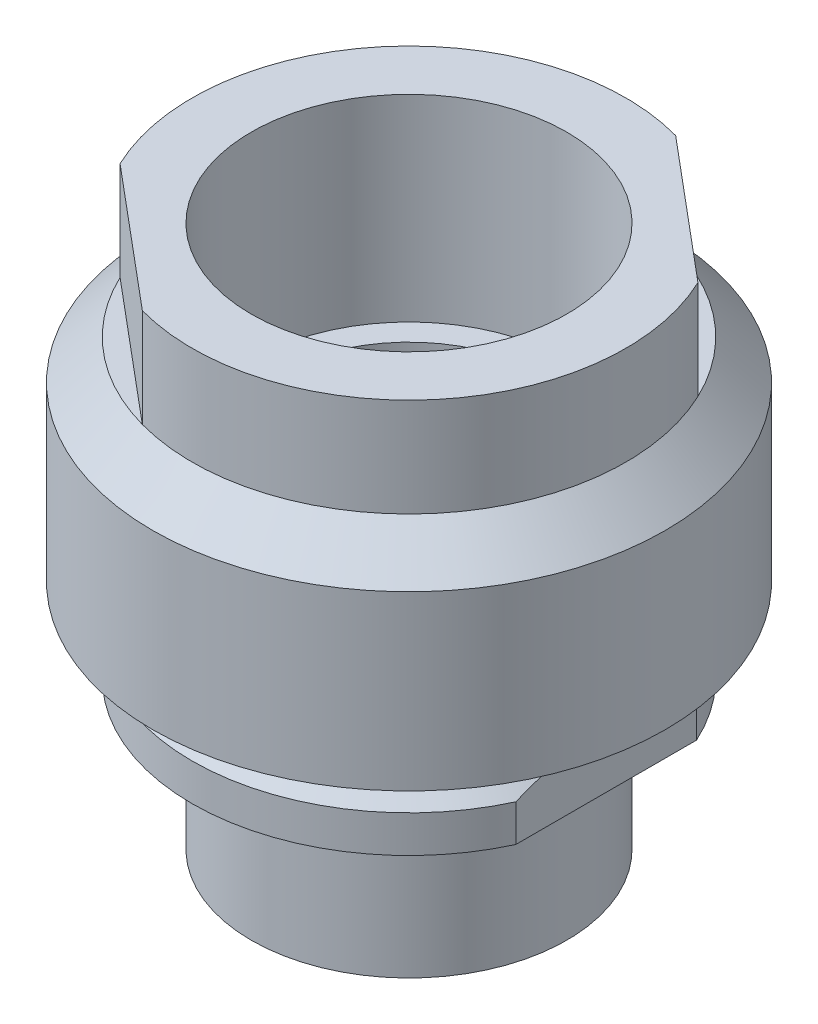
ISO-10303-21;
HEADER;
FILE_DESCRIPTION(('STEP AP214'),'2;1');
FILE_NAME('part.step','',(''),(''),'','','');
FILE_SCHEMA(('AUTOMOTIVE_DESIGN { 1 0 10303 214 1 1 1 1 }'));
ENDSEC;
DATA;
#1=APPLICATION_CONTEXT('core data for automotive mechanical design processes');
#2=APPLICATION_PROTOCOL_DEFINITION('international standard','automotive_design',2000,#1);
#3=PRODUCT_CONTEXT('',#1,'mechanical');
#4=PRODUCT('Part','Part','',(#3));
#5=PRODUCT_RELATED_PRODUCT_CATEGORY('part','',(#4));
#6=PRODUCT_DEFINITION_FORMATION('','',#4);
#7=PRODUCT_DEFINITION_CONTEXT('part definition',#1,'design');
#8=PRODUCT_DEFINITION('design','',#6,#7);
#9=PRODUCT_DEFINITION_SHAPE('','',#8);
#10=(LENGTH_UNIT() NAMED_UNIT(*) SI_UNIT(.MILLI.,.METRE.));
#11=(NAMED_UNIT(*) PLANE_ANGLE_UNIT() SI_UNIT($,.RADIAN.));
#12=(NAMED_UNIT(*) SI_UNIT($,.STERADIAN.) SOLID_ANGLE_UNIT());
#13=UNCERTAINTY_MEASURE_WITH_UNIT(LENGTH_MEASURE(1.E-05),#10,'distance_accuracy_value','');
#14=(GEOMETRIC_REPRESENTATION_CONTEXT(3) GLOBAL_UNCERTAINTY_ASSIGNED_CONTEXT((#13)) GLOBAL_UNIT_ASSIGNED_CONTEXT((#10,
#11,#12)) REPRESENTATION_CONTEXT('',''));
#15=CARTESIAN_POINT('',(0.,0.,0.));
#16=DIRECTION('',(0.,0.,1.));
#17=DIRECTION('',(1.,0.,0.));
#18=AXIS2_PLACEMENT_3D('',#15,#16,#17);
#19=CARTESIAN_POINT('',(0.,0.,0.));
#20=DIRECTION('',(0.,-1.,0.));
#21=DIRECTION('',(0.,0.,-1.));
#22=AXIS2_PLACEMENT_3D('',#19,#20,#21);
#23=CYLINDRICAL_SURFACE('',#22,22.);
#24=DIRECTION('',(0.,1.,0.));
#25=VECTOR('',#24,1.);
#26=CARTESIAN_POINT('',(-5.83483890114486,30.,21.2121346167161));
#27=LINE('',#26,#25);
#28=CARTESIAN_POINT('',(-5.83483890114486,30.,21.2121346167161));
#29=VERTEX_POINT('',#28);
#30=CARTESIAN_POINT('',(-5.83483890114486,40.,21.2121346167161));
#31=VERTEX_POINT('',#30);
#32=EDGE_CURVE('E167',#29,#31,#27,.T.);
#33=ORIENTED_EDGE('',*,*,#32,.F.);
#34=CARTESIAN_POINT('',(0.,30.,0.));
#35=DIRECTION('',(0.,-1.,0.));
#36=DIRECTION('',(0.,0.,-1.));
#37=AXIS2_PLACEMENT_3D('',#34,#35,#36);
#38=CIRCLE('',#37,22.);
#39=CARTESIAN_POINT('',(19.8766654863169,30.,-9.42964310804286));
#40=VERTEX_POINT('',#39);
#41=EDGE_CURVE('E178',#40,#29,#38,.T.);
#42=ORIENTED_EDGE('',*,*,#41,.F.);
#43=DIRECTION('',(0.,1.,0.));
#44=VECTOR('',#43,1.);
#45=CARTESIAN_POINT('',(19.8766654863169,30.,-9.42964310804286));
#46=LINE('',#45,#44);
#47=CARTESIAN_POINT('',(19.8766654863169,40.,-9.42964310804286));
#48=VERTEX_POINT('',#47);
#49=EDGE_CURVE('E262',#40,#48,#46,.T.);
#50=ORIENTED_EDGE('',*,*,#49,.T.);
#51=CARTESIAN_POINT('',(0.,40.,0.));
#52=DIRECTION('',(0.,-1.,0.));
#53=DIRECTION('',(0.,0.,-1.));
#54=AXIS2_PLACEMENT_3D('',#51,#52,#53);
#55=CIRCLE('',#54,22.);
#56=EDGE_CURVE('E181',#48,#31,#55,.T.);
#57=ORIENTED_EDGE('',*,*,#56,.T.);
#58=EDGE_LOOP('',(#33,#42,#50,#57));
#59=FACE_BOUND('',#58,.T.);
#60=ADVANCED_FACE('F44',(#59),#23,.T.);
#61=CARTESIAN_POINT('',(0.,0.,0.));
#62=DIRECTION('',(0.,-1.,0.));
#63=DIRECTION('',(0.,0.,-1.));
#64=AXIS2_PLACEMENT_3D('',#61,#62,#63);
#65=CYLINDRICAL_SURFACE('',#64,22.);
#66=DIRECTION('',(0.,-1.,0.));
#67=VECTOR('',#66,1.);
#68=CARTESIAN_POINT('',(-20.,20.,9.16515138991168));
#69=LINE('',#68,#67);
#70=CARTESIAN_POINT('',(-20.,3.74999999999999,9.16515138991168));
#71=VERTEX_POINT('',#70);
#72=CARTESIAN_POINT('',(-20.,0.,9.16515138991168));
#73=VERTEX_POINT('',#72);
#74=EDGE_CURVE('E269',#71,#73,#69,.T.);
#75=ORIENTED_EDGE('',*,*,#74,.T.);
#76=CARTESIAN_POINT('',(0.,0.,0.));
#77=DIRECTION('',(0.,-1.,0.));
#78=DIRECTION('',(0.,0.,-1.));
#79=AXIS2_PLACEMENT_3D('',#76,#77,#78);
#80=CIRCLE('',#79,22.);
#81=CARTESIAN_POINT('',(20.,0.,9.16515138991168));
#82=VERTEX_POINT('',#81);
#83=EDGE_CURVE('E379',#82,#73,#80,.T.);
#84=ORIENTED_EDGE('',*,*,#83,.F.);
#85=DIRECTION('',(0.,-1.,0.));
#86=VECTOR('',#85,1.);
#87=CARTESIAN_POINT('',(20.,20.,9.16515138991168));
#88=LINE('',#87,#86);
#89=CARTESIAN_POINT('',(20.,3.74999999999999,9.16515138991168));
#90=VERTEX_POINT('',#89);
#91=EDGE_CURVE('E316',#90,#82,#88,.T.);
#92=ORIENTED_EDGE('',*,*,#91,.F.);
#93=CARTESIAN_POINT('',(0.,3.74999999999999,0.));
#94=DIRECTION('',(0.,-1.,0.));
#95=DIRECTION('',(0.,0.,-1.));
#96=AXIS2_PLACEMENT_3D('',#93,#94,#95);
#97=CIRCLE('',#96,22.);
#98=EDGE_CURVE('E378',#90,#71,#97,.T.);
#99=ORIENTED_EDGE('',*,*,#98,.T.);
#100=EDGE_LOOP('',(#75,#84,#92,#99));
#101=FACE_BOUND('',#100,.T.);
#102=ADVANCED_FACE('F229',(#101),#65,.T.);
#103=CARTESIAN_POINT('',(0.,0.,0.));
#104=DIRECTION('',(0.,-1.,0.));
#105=DIRECTION('',(0.,0.,-1.));
#106=AXIS2_PLACEMENT_3D('',#103,#104,#105);
#107=CYLINDRICAL_SURFACE('',#106,16.);
#108=CARTESIAN_POINT('',(0.,0.,0.));
#109=DIRECTION('',(0.,-1.,0.));
#110=DIRECTION('',(0.,0.,-1.));
#111=AXIS2_PLACEMENT_3D('',#108,#109,#110);
#112=CIRCLE('',#111,16.);
#113=CARTESIAN_POINT('',(0.,0.,-16.));
#114=VERTEX_POINT('',#113);
#115=EDGE_CURVE('E611',#114,#114,#112,.T.);
#116=ORIENTED_EDGE('',*,*,#115,.T.);
#117=EDGE_LOOP('',(#116));
#118=FACE_BOUND('',#117,.T.);
#119=CARTESIAN_POINT('',(0.,-15.,0.));
#120=DIRECTION('',(0.,-1.,0.));
#121=DIRECTION('',(0.,0.,-1.));
#122=AXIS2_PLACEMENT_3D('',#119,#120,#121);
#123=CIRCLE('',#122,16.);
#124=CARTESIAN_POINT('',(0.,-15.,-16.));
#125=VERTEX_POINT('',#124);
#126=EDGE_CURVE('E11',#125,#125,#123,.T.);
#127=ORIENTED_EDGE('',*,*,#126,.F.);
#128=EDGE_LOOP('',(#127));
#129=FACE_BOUND('',#128,.T.);
#130=ADVANCED_FACE('F46',(#118,#129),#107,.T.);
#131=CARTESIAN_POINT('',(13.5,-15.,0.));
#132=DIRECTION('',(0.,-1.,0.));
#133=DIRECTION('',(0.,0.,-1.));
#134=AXIS2_PLACEMENT_3D('',#131,#132,#133);
#135=PLANE('',#134);
#136=ORIENTED_EDGE('',*,*,#126,.T.);
#137=EDGE_LOOP('',(#136));
#138=FACE_BOUND('',#137,.T.);
#139=CARTESIAN_POINT('',(0.,-15.,0.));
#140=DIRECTION('',(0.,-1.,0.));
#141=DIRECTION('',(0.,0.,-1.));
#142=AXIS2_PLACEMENT_3D('',#139,#140,#141);
#143=CIRCLE('',#142,13.5);
#144=CARTESIAN_POINT('',(0.,-15.,-13.5));
#145=VERTEX_POINT('',#144);
#146=EDGE_CURVE('E53',#145,#145,#143,.T.);
#147=ORIENTED_EDGE('',*,*,#146,.F.);
#148=EDGE_LOOP('',(#147));
#149=FACE_BOUND('',#148,.T.);
#150=ADVANCED_FACE('F220',(#138,#149),#135,.T.);
#151=CARTESIAN_POINT('',(0.,0.,0.));
#152=DIRECTION('',(0.,-1.,0.));
#153=DIRECTION('',(0.,0.,-1.));
#154=AXIS2_PLACEMENT_3D('',#151,#152,#153);
#155=CYLINDRICAL_SURFACE('',#154,13.5);
#156=ORIENTED_EDGE('',*,*,#146,.T.);
#157=EDGE_LOOP('',(#156));
#158=FACE_BOUND('',#157,.T.);
#159=CARTESIAN_POINT('',(0.,20.,0.));
#160=DIRECTION('',(0.,-1.,0.));
#161=DIRECTION('',(0.,0.,-1.));
#162=AXIS2_PLACEMENT_3D('',#159,#160,#161);
#163=CIRCLE('',#162,13.5);
#164=CARTESIAN_POINT('',(0.,20.,-13.5));
#165=VERTEX_POINT('',#164);
#166=EDGE_CURVE('E209',#165,#165,#163,.T.);
#167=ORIENTED_EDGE('',*,*,#166,.F.);
#168=EDGE_LOOP('',(#167));
#169=FACE_BOUND('',#168,.T.);
#170=ADVANCED_FACE('F217',(#158,#169),#155,.F.);
#171=CARTESIAN_POINT('',(13.5,20.,0.));
#172=DIRECTION('',(0.,1.,0.));
#173=DIRECTION('',(0.,0.,1.));
#174=AXIS2_PLACEMENT_3D('',#171,#172,#173);
#175=PLANE('',#174);
#176=ORIENTED_EDGE('',*,*,#166,.T.);
#177=EDGE_LOOP('',(#176));
#178=FACE_BOUND('',#177,.T.);
#179=CARTESIAN_POINT('',(0.,20.,0.));
#180=DIRECTION('',(0.,-1.,0.));
#181=DIRECTION('',(0.,0.,-1.));
#182=AXIS2_PLACEMENT_3D('',#179,#180,#181);
#183=CIRCLE('',#182,16.);
#184=CARTESIAN_POINT('',(0.,20.,-16.));
#185=VERTEX_POINT('',#184);
#186=EDGE_CURVE('E205',#185,#185,#183,.T.);
#187=ORIENTED_EDGE('',*,*,#186,.F.);
#188=EDGE_LOOP('',(#187));
#189=FACE_BOUND('',#188,.T.);
#190=ADVANCED_FACE('F227',(#178,#189),#175,.T.);
#191=CARTESIAN_POINT('',(0.,0.,0.));
#192=DIRECTION('',(0.,-1.,0.));
#193=DIRECTION('',(0.,0.,-1.));
#194=AXIS2_PLACEMENT_3D('',#191,#192,#193);
#195=CYLINDRICAL_SURFACE('',#194,16.);
#196=ORIENTED_EDGE('',*,*,#186,.T.);
#197=EDGE_LOOP('',(#196));
#198=FACE_BOUND('',#197,.T.);
#199=CARTESIAN_POINT('',(0.,40.,0.));
#200=DIRECTION('',(0.,-1.,0.));
#201=DIRECTION('',(0.,0.,-1.));
#202=AXIS2_PLACEMENT_3D('',#199,#200,#201);
#203=CIRCLE('',#202,16.);
#204=CARTESIAN_POINT('',(0.,40.,-16.));
#205=VERTEX_POINT('',#204);
#206=EDGE_CURVE('E201',#205,#205,#203,.T.);
#207=ORIENTED_EDGE('',*,*,#206,.F.);
#208=EDGE_LOOP('',(#207));
#209=FACE_BOUND('',#208,.T.);
#210=ADVANCED_FACE('F250',(#198,#209),#195,.F.);
#211=CARTESIAN_POINT('',(22.,40.,0.));
#212=DIRECTION('',(0.,1.,0.));
#213=DIRECTION('',(0.,0.,1.));
#214=AXIS2_PLACEMENT_3D('',#211,#212,#213);
#215=PLANE('',#214);
#216=DIRECTION('',(-0.766044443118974,0.,-0.642787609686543));
#217=VECTOR('',#216,1.);
#218=CARTESIAN_POINT('',(-19.8766654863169,40.,9.42964310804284));
#219=LINE('',#218,#217);
#220=CARTESIAN_POINT('',(-19.8766654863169,40.,9.42964310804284));
#221=VERTEX_POINT('',#220);
#222=EDGE_CURVE('E162',#31,#221,#219,.T.);
#223=ORIENTED_EDGE('',*,*,#222,.F.);
#224=ORIENTED_EDGE('',*,*,#56,.F.);
#225=DIRECTION('',(0.766044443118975,0.,0.642787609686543));
#226=VECTOR('',#225,1.);
#227=CARTESIAN_POINT('',(5.83483890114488,40.,-21.2121346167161));
#228=LINE('',#227,#226);
#229=CARTESIAN_POINT('',(5.83483890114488,40.,-21.2121346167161));
#230=VERTEX_POINT('',#229);
#231=EDGE_CURVE('E256',#230,#48,#228,.T.);
#232=ORIENTED_EDGE('',*,*,#231,.F.);
#233=EDGE_CURVE('E193',#221,#230,#55,.T.);
#234=ORIENTED_EDGE('',*,*,#233,.F.);
#235=EDGE_LOOP('',(#223,#224,#232,#234));
#236=FACE_BOUND('',#235,.T.);
#237=ORIENTED_EDGE('',*,*,#206,.T.);
#238=EDGE_LOOP('',(#237));
#239=FACE_BOUND('',#238,.T.);
#240=ADVANCED_FACE('F243',(#236,#239),#215,.T.);
#241=DIRECTION('',(0.,1.,0.));
#242=VECTOR('',#241,1.);
#243=CARTESIAN_POINT('',(-19.8766654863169,30.,9.42964310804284));
#244=LINE('',#243,#242);
#245=CARTESIAN_POINT('',(-19.8766654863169,30.,9.42964310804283));
#246=VERTEX_POINT('',#245);
#247=EDGE_CURVE('E170',#246,#221,#244,.T.);
#248=ORIENTED_EDGE('',*,*,#247,.T.);
#249=ORIENTED_EDGE('',*,*,#233,.T.);
#250=DIRECTION('',(0.,1.,0.));
#251=VECTOR('',#250,1.);
#252=CARTESIAN_POINT('',(5.83483890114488,30.,-21.2121346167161));
#253=LINE('',#252,#251);
#254=CARTESIAN_POINT('',(5.83483890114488,30.,-21.2121346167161));
#255=VERTEX_POINT('',#254);
#256=EDGE_CURVE('E261',#255,#230,#253,.T.);
#257=ORIENTED_EDGE('',*,*,#256,.F.);
#258=EDGE_CURVE('E188',#246,#255,#38,.T.);
#259=ORIENTED_EDGE('',*,*,#258,.F.);
#260=EDGE_LOOP('',(#248,#249,#257,#259));
#261=FACE_BOUND('',#260,.T.);
#262=ADVANCED_FACE('F233',(#261),#23,.T.);
#263=CARTESIAN_POINT('',(0.,26.,0.));
#264=DIRECTION('',(0.,-1.,0.));
#265=DIRECTION('',(0.,0.,-1.));
#266=AXIS2_PLACEMENT_3D('',#263,#264,#265);
#267=CONICAL_SURFACE('',#266,26.,0.785398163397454);
#268=EDGE_CURVE('E186',#255,#40,#38,.T.);
#269=ORIENTED_EDGE('',*,*,#268,.T.);
#270=ORIENTED_EDGE('',*,*,#41,.T.);
#271=CARTESIAN_POINT('',(0.,30.,0.));
#272=DIRECTION('',(0.,1.,0.));
#273=DIRECTION('',(0.,0.,1.));
#274=AXIS2_PLACEMENT_3D('',#271,#272,#273);
#275=CIRCLE('',#274,22.);
#276=EDGE_CURVE('E157',#246,#29,#275,.T.);
#277=ORIENTED_EDGE('',*,*,#276,.F.);
#278=ORIENTED_EDGE('',*,*,#258,.T.);
#279=EDGE_LOOP('',(#269,#270,#277,#278));
#280=FACE_BOUND('',#279,.T.);
#281=CARTESIAN_POINT('',(0.,26.,0.));
#282=DIRECTION('',(0.,-1.,0.));
#283=DIRECTION('',(0.,0.,-1.));
#284=AXIS2_PLACEMENT_3D('',#281,#282,#283);
#285=CIRCLE('',#284,26.);
#286=CARTESIAN_POINT('',(0.,26.,-26.));
#287=VERTEX_POINT('',#286);
#288=EDGE_CURVE('E195',#287,#287,#285,.T.);
#289=ORIENTED_EDGE('',*,*,#288,.F.);
#290=EDGE_LOOP('',(#289));
#291=FACE_BOUND('',#290,.T.);
#292=ADVANCED_FACE('F184',(#280,#291),#267,.T.);
#293=CARTESIAN_POINT('',(0.,0.,0.));
#294=DIRECTION('',(0.,-1.,0.));
#295=DIRECTION('',(0.,0.,-1.));
#296=AXIS2_PLACEMENT_3D('',#293,#294,#295);
#297=CYLINDRICAL_SURFACE('',#296,26.);
#298=ORIENTED_EDGE('',*,*,#288,.T.);
#299=EDGE_LOOP('',(#298));
#300=FACE_BOUND('',#299,.T.);
#301=CARTESIAN_POINT('',(0.,8.5,0.));
#302=DIRECTION('',(0.,-1.,0.));
#303=DIRECTION('',(0.,0.,-1.));
#304=AXIS2_PLACEMENT_3D('',#301,#302,#303);
#305=CIRCLE('',#304,26.);
#306=CARTESIAN_POINT('',(0.,8.5,-26.));
#307=VERTEX_POINT('',#306);
#308=EDGE_CURVE('E403',#307,#307,#305,.T.);
#309=ORIENTED_EDGE('',*,*,#308,.F.);
#310=EDGE_LOOP('',(#309));
#311=FACE_BOUND('',#310,.T.);
#312=ADVANCED_FACE('F249',(#300,#311),#297,.T.);
#313=CARTESIAN_POINT('',(23.5,8.5,0.));
#314=DIRECTION('',(0.,-1.,0.));
#315=DIRECTION('',(0.,0.,-1.));
#316=AXIS2_PLACEMENT_3D('',#313,#314,#315);
#317=PLANE('',#316);
#318=ORIENTED_EDGE('',*,*,#308,.T.);
#319=EDGE_LOOP('',(#318));
#320=FACE_BOUND('',#319,.T.);
#321=CARTESIAN_POINT('',(0.,8.5,0.));
#322=DIRECTION('',(0.,-1.,0.));
#323=DIRECTION('',(0.,0.,-1.));
#324=AXIS2_PLACEMENT_3D('',#321,#322,#323);
#325=CIRCLE('',#324,23.5);
#326=CARTESIAN_POINT('',(0.,8.5,-23.5));
#327=VERTEX_POINT('',#326);
#328=EDGE_CURVE('E400',#327,#327,#325,.T.);
#329=ORIENTED_EDGE('',*,*,#328,.F.);
#330=EDGE_LOOP('',(#329));
#331=FACE_BOUND('',#330,.T.);
#332=ADVANCED_FACE('F413',(#320,#331),#317,.T.);
#333=CARTESIAN_POINT('',(0.,0.,0.));
#334=DIRECTION('',(0.,-1.,0.));
#335=DIRECTION('',(0.,0.,-1.));
#336=AXIS2_PLACEMENT_3D('',#333,#334,#335);
#337=CYLINDRICAL_SURFACE('',#336,23.5);
#338=ORIENTED_EDGE('',*,*,#328,.T.);
#339=EDGE_LOOP('',(#338));
#340=FACE_BOUND('',#339,.T.);
#341=CARTESIAN_POINT('',(0.,10.5,0.));
#342=DIRECTION('',(0.,-1.,0.));
#343=DIRECTION('',(0.,0.,-1.));
#344=AXIS2_PLACEMENT_3D('',#341,#342,#343);
#345=CIRCLE('',#344,23.5);
#346=CARTESIAN_POINT('',(0.,10.5,-23.5));
#347=VERTEX_POINT('',#346);
#348=EDGE_CURVE('E396',#347,#347,#345,.T.);
#349=ORIENTED_EDGE('',*,*,#348,.F.);
#350=EDGE_LOOP('',(#349));
#351=FACE_BOUND('',#350,.T.);
#352=ADVANCED_FACE('F418',(#340,#351),#337,.F.);
#353=CARTESIAN_POINT('',(23.5,10.5,0.));
#354=DIRECTION('',(0.,-1.,0.));
#355=DIRECTION('',(0.,0.,-1.));
#356=AXIS2_PLACEMENT_3D('',#353,#354,#355);
#357=PLANE('',#356);
#358=CARTESIAN_POINT('',(0.,10.5,0.));
#359=DIRECTION('',(0.,-1.,0.));
#360=DIRECTION('',(0.,0.,-1.));
#361=AXIS2_PLACEMENT_3D('',#358,#359,#360);
#362=CIRCLE('',#361,22.);
#363=CARTESIAN_POINT('',(-20.,10.5,9.16515138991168));
#364=VERTEX_POINT('',#363);
#365=CARTESIAN_POINT('',(-20.,10.5,-9.16515138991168));
#366=VERTEX_POINT('',#365);
#367=EDGE_CURVE('E294',#364,#366,#362,.T.);
#368=ORIENTED_EDGE('',*,*,#367,.F.);
#369=DIRECTION('',(0.,0.,1.));
#370=VECTOR('',#369,1.);
#371=CARTESIAN_POINT('',(-20.,10.5,0.));
#372=LINE('',#371,#370);
#373=EDGE_CURVE('E291',#366,#364,#372,.T.);
#374=ORIENTED_EDGE('',*,*,#373,.F.);
#375=EDGE_LOOP('',(#368,#374));
#376=FACE_BOUND('',#375,.T.);
#377=CARTESIAN_POINT('',(0.,10.5,0.));
#378=DIRECTION('',(0.,-1.,0.));
#379=DIRECTION('',(0.,0.,-1.));
#380=AXIS2_PLACEMENT_3D('',#377,#378,#379);
#381=CIRCLE('',#380,22.);
#382=CARTESIAN_POINT('',(20.,10.5,-9.16515138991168));
#383=VERTEX_POINT('',#382);
#384=CARTESIAN_POINT('',(20.,10.5,9.16515138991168));
#385=VERTEX_POINT('',#384);
#386=EDGE_CURVE('E614',#383,#385,#381,.T.);
#387=ORIENTED_EDGE('',*,*,#386,.F.);
#388=DIRECTION('',(0.,0.,-1.));
#389=VECTOR('',#388,1.);
#390=CARTESIAN_POINT('',(20.,10.5,0.));
#391=LINE('',#390,#389);
#392=EDGE_CURVE('E335',#385,#383,#391,.T.);
#393=ORIENTED_EDGE('',*,*,#392,.F.);
#394=EDGE_LOOP('',(#387,#393));
#395=FACE_BOUND('',#394,.T.);
#396=ORIENTED_EDGE('',*,*,#348,.T.);
#397=EDGE_LOOP('',(#396));
#398=FACE_BOUND('',#397,.T.);
#399=CARTESIAN_POINT('',(0.,10.5,0.));
#400=DIRECTION('',(0.,-1.,0.));
#401=DIRECTION('',(0.,0.,-1.));
#402=AXIS2_PLACEMENT_3D('',#399,#400,#401);
#403=CIRCLE('',#402,18.75);
#404=CARTESIAN_POINT('',(0.,10.5,-18.75));
#405=VERTEX_POINT('',#404);
#406=EDGE_CURVE('E392',#405,#405,#403,.T.);
#407=ORIENTED_EDGE('',*,*,#406,.F.);
#408=EDGE_LOOP('',(#407));
#409=FACE_BOUND('',#408,.T.);
#410=ADVANCED_FACE('F423',(#376,#395,#398,#409),#357,.T.);
#411=CARTESIAN_POINT('',(0.,0.,0.));
#412=DIRECTION('',(0.,-1.,0.));
#413=DIRECTION('',(0.,0.,-1.));
#414=AXIS2_PLACEMENT_3D('',#411,#412,#413);
#415=CYLINDRICAL_SURFACE('',#414,18.75);
#416=ORIENTED_EDGE('',*,*,#406,.T.);
#417=EDGE_LOOP('',(#416));
#418=FACE_BOUND('',#417,.T.);
#419=CARTESIAN_POINT('',(0.,7.,0.));
#420=DIRECTION('',(0.,-1.,0.));
#421=DIRECTION('',(0.,0.,-1.));
#422=AXIS2_PLACEMENT_3D('',#419,#420,#421);
#423=CIRCLE('',#422,18.75);
#424=CARTESIAN_POINT('',(0.,7.,-18.75));
#425=VERTEX_POINT('',#424);
#426=EDGE_CURVE('E383',#425,#425,#423,.T.);
#427=ORIENTED_EDGE('',*,*,#426,.F.);
#428=EDGE_LOOP('',(#427));
#429=FACE_BOUND('',#428,.T.);
#430=ADVANCED_FACE('F361',(#418,#429),#415,.T.);
#431=CARTESIAN_POINT('',(0.,3.74999999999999,0.));
#432=DIRECTION('',(0.,-1.,0.));
#433=DIRECTION('',(0.,0.,-1.));
#434=AXIS2_PLACEMENT_3D('',#431,#432,#433);
#435=CONICAL_SURFACE('',#434,22.,0.785398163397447);
#436=CARTESIAN_POINT('',(-20.,-2.15360715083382,-19.4579364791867));
#437=CARTESIAN_POINT('',(-20.,-1.98378375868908,-19.2143973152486));
#438=CARTESIAN_POINT('',(-20.,-1.81505848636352,-18.9700932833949));
#439=CARTESIAN_POINT('',(-20.,-1.47999530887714,-18.479845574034));
#440=CARTESIAN_POINT('',(-20.,-1.31365745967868,-18.2339018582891));
#441=CARTESIAN_POINT('',(-20.,-0.818433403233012,-17.4933285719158));
#442=CARTESIAN_POINT('',(-20.,-0.493429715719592,-16.9960898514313));
#443=CARTESIAN_POINT('',(-20.,0.146635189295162,-15.9901210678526));
#444=CARTESIAN_POINT('',(-20.,0.461606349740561,-15.4813335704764));
#445=CARTESIAN_POINT('',(-20.,1.0766530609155,-14.4548572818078));
#446=CARTESIAN_POINT('',(-20.,1.37672979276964,-13.9371692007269));
#447=CARTESIAN_POINT('',(-20.,1.96915343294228,-12.8736344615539));
#448=CARTESIAN_POINT('',(-20.,2.26086919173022,-12.3274344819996));
#449=CARTESIAN_POINT('',(-20.,2.8211472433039,-11.2231323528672));
#450=CARTESIAN_POINT('',(-20.,3.08970672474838,-10.6650287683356));
#451=CARTESIAN_POINT('',(-20.,3.59791134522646,-9.53768334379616));
#452=CARTESIAN_POINT('',(-20.,3.83763887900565,-8.96847892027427));
#453=CARTESIAN_POINT('',(-20.,4.28316945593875,-7.81705859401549));
#454=CARTESIAN_POINT('',(-20.,4.48898508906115,-7.23484761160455));
#455=CARTESIAN_POINT('',(-20.,4.83208067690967,-6.14684657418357));
#456=CARTESIAN_POINT('',(-20.,4.97502087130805,-5.64285836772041));
#457=CARTESIAN_POINT('',(-20.,5.16455195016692,-4.88070457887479));
#458=CARTESIAN_POINT('',(-20.,5.22358645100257,-4.62560251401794));
#459=CARTESIAN_POINT('',(-20.,5.33289883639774,-4.11347049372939));
#460=CARTESIAN_POINT('',(-20.,5.38317474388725,-3.85644011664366));
#461=CARTESIAN_POINT('',(-20.,5.51910819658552,-3.08876149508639));
#462=CARTESIAN_POINT('',(-20.,5.5913474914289,-2.57565690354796));
#463=CARTESIAN_POINT('',(-20.,5.69691989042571,-1.54544005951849));
#464=CARTESIAN_POINT('',(-20.,5.73025526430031,-1.02832804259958));
#465=CARTESIAN_POINT('',(-20.,5.75146190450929,-0.198325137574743));
#466=CARTESIAN_POINT('',(-20.,5.75211490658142,0.114286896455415));
#467=CARTESIAN_POINT('',(-20.,5.73878079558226,0.739192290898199));
#468=CARTESIAN_POINT('',(-20.,5.7247945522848,1.05148566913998));
#469=CARTESIAN_POINT('',(-20.,5.68238171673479,1.67514498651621));
#470=CARTESIAN_POINT('',(-20.,5.65395245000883,1.98651074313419));
#471=CARTESIAN_POINT('',(-20.,5.58308471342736,2.6076351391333));
#472=CARTESIAN_POINT('',(-20.,5.54064557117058,2.9173937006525));
#473=CARTESIAN_POINT('',(-20.,5.3917984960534,3.85194982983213));
#474=CARTESIAN_POINT('',(-20.,5.26446169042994,4.47350801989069));
#475=CARTESIAN_POINT('',(-20.,4.961012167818,5.70423771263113));
#476=CARTESIAN_POINT('',(-20.,4.78490531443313,6.31341069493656));
#477=CARTESIAN_POINT('',(-20.,4.38430850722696,7.53923762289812));
#478=CARTESIAN_POINT('',(-20.,4.15833642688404,8.15540281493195));
#479=CARTESIAN_POINT('',(-20.,3.66961211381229,9.37309052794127));
#480=CARTESIAN_POINT('',(-20.,3.4068451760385,9.97460708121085));
#481=CARTESIAN_POINT('',(-20.,2.85051049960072,11.1653283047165));
#482=CARTESIAN_POINT('',(-20.,2.55685215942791,11.7544903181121));
#483=CARTESIAN_POINT('',(-20.,1.94506342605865,12.9197865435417));
#484=CARTESIAN_POINT('',(-20.,1.62693628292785,13.4959224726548));
#485=CARTESIAN_POINT('',(-20.,0.983453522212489,14.6144727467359));
#486=CARTESIAN_POINT('',(-20.,0.658859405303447,15.1573274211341));
#487=CARTESIAN_POINT('',(-20.,-0.0056100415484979,16.2336274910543));
#488=CARTESIAN_POINT('',(-20.,-0.345486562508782,16.7670721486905));
#489=CARTESIAN_POINT('',(-20.,-1.03528098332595,17.8215905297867));
#490=CARTESIAN_POINT('',(-20.,-1.38510215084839,18.3427276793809));
#491=CARTESIAN_POINT('',(-20.,-1.91764665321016,19.1189442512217));
#492=CARTESIAN_POINT('',(-20.,-2.09643886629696,19.3767337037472));
#493=CARTESIAN_POINT('',(-20.,-2.45643497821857,19.8906148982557));
#494=CARTESIAN_POINT('',(-20.,-2.63763882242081,20.1467066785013));
#495=CARTESIAN_POINT('',(-20.,-2.81994894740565,20.4020092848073));
#496=B_SPLINE_CURVE_WITH_KNOTS('',3,(#436,#437,#438,#439,#440,#441,#442,#443,#444,#445,#446,
#447,#448,#449,#450,#451,#452,#453,#454,#455,#456,#457,#458,#459,#460,#461,#462,#463,#464,#465,
#466,#467,#468,#469,#470,#471,#472,#473,#474,#475,#476,#477,#478,#479,#480,#481,#482,#483,#484,
#485,#486,#487,#488,#489,#490,#491,#492,#493,#494,#495),.UNSPECIFIED.,.F.,.F.,(4,2,2,2,2,2,2,2,
2,2,2,2,2,2,2,2,2,2,2,2,2,2,2,2,2,2,2,2,2,4),(0.,0.890702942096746,1.78142672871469,
3.56336110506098,5.35832271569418,7.15314175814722,9.01034185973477,10.8677671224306,
12.7197514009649,14.5710465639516,16.1415640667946,16.9269580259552,17.7125290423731,
19.2655566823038,20.8184937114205,21.7560219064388,22.6934944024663,23.6311405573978,
24.5688317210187,26.469745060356,28.3704299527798,30.337873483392,32.3061055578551,
34.2802803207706,36.2541933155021,38.1513877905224,40.0487303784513,41.9315551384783,
42.872712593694,43.813848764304),.UNSPECIFIED.);
#497=CARTESIAN_POINT('',(-20.,3.74999999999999,-9.16515138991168));
#498=VERTEX_POINT('',#497);
#499=EDGE_CURVE('E268',#71,#498,#496,.F.);
#500=ORIENTED_EDGE('',*,*,#499,.F.);
#501=ORIENTED_EDGE('',*,*,#98,.F.);
#502=CARTESIAN_POINT('',(20.,-2.15360715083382,-19.4579364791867));
#503=CARTESIAN_POINT('',(20.,-1.98378375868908,-19.2143973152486));
#504=CARTESIAN_POINT('',(20.,-1.81505848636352,-18.9700932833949));
#505=CARTESIAN_POINT('',(20.,-1.47999530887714,-18.479845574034));
#506=CARTESIAN_POINT('',(20.,-1.31365745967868,-18.2339018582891));
#507=CARTESIAN_POINT('',(20.,-0.818433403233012,-17.4933285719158));
#508=CARTESIAN_POINT('',(20.,-0.493429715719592,-16.9960898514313));
#509=CARTESIAN_POINT('',(20.,0.146635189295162,-15.9901210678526));
#510=CARTESIAN_POINT('',(20.,0.461606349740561,-15.4813335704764));
#511=CARTESIAN_POINT('',(20.,1.0766530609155,-14.4548572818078));
#512=CARTESIAN_POINT('',(20.,1.37672979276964,-13.9371692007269));
#513=CARTESIAN_POINT('',(20.,1.96915343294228,-12.8736344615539));
#514=CARTESIAN_POINT('',(20.,2.26086919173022,-12.3274344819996));
#515=CARTESIAN_POINT('',(20.,2.8211472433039,-11.2231323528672));
#516=CARTESIAN_POINT('',(20.,3.08970672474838,-10.6650287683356));
#517=CARTESIAN_POINT('',(20.,3.59791134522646,-9.53768334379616));
#518=CARTESIAN_POINT('',(20.,3.83763887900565,-8.96847892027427));
#519=CARTESIAN_POINT('',(20.,4.28316945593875,-7.81705859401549));
#520=CARTESIAN_POINT('',(20.,4.48898508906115,-7.23484761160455));
#521=CARTESIAN_POINT('',(20.,4.83208067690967,-6.14684657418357));
#522=CARTESIAN_POINT('',(20.,4.97502087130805,-5.64285836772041));
#523=CARTESIAN_POINT('',(20.,5.16455195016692,-4.88070457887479));
#524=CARTESIAN_POINT('',(20.,5.22358645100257,-4.62560251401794));
#525=CARTESIAN_POINT('',(20.,5.33289883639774,-4.11347049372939));
#526=CARTESIAN_POINT('',(20.,5.38317474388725,-3.85644011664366));
#527=CARTESIAN_POINT('',(20.,5.51910819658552,-3.08876149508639));
#528=CARTESIAN_POINT('',(20.,5.5913474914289,-2.57565690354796));
#529=CARTESIAN_POINT('',(20.,5.69691989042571,-1.54544005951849));
#530=CARTESIAN_POINT('',(20.,5.73025526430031,-1.02832804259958));
#531=CARTESIAN_POINT('',(20.,5.75146190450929,-0.198325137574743));
#532=CARTESIAN_POINT('',(20.,5.75211490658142,0.114286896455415));
#533=CARTESIAN_POINT('',(20.,5.73878079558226,0.739192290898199));
#534=CARTESIAN_POINT('',(20.,5.7247945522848,1.05148566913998));
#535=CARTESIAN_POINT('',(20.,5.68238171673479,1.67514498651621));
#536=CARTESIAN_POINT('',(20.,5.65395245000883,1.98651074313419));
#537=CARTESIAN_POINT('',(20.,5.58308471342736,2.6076351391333));
#538=CARTESIAN_POINT('',(20.,5.54064557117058,2.9173937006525));
#539=CARTESIAN_POINT('',(20.,5.3917984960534,3.85194982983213));
#540=CARTESIAN_POINT('',(20.,5.26446169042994,4.47350801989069));
#541=CARTESIAN_POINT('',(20.,4.961012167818,5.70423771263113));
#542=CARTESIAN_POINT('',(20.,4.78490531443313,6.31341069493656));
#543=CARTESIAN_POINT('',(20.,4.38430850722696,7.53923762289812));
#544=CARTESIAN_POINT('',(20.,4.15833642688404,8.15540281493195));
#545=CARTESIAN_POINT('',(20.,3.66961211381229,9.37309052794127));
#546=CARTESIAN_POINT('',(20.,3.4068451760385,9.97460708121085));
#547=CARTESIAN_POINT('',(20.,2.85051049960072,11.1653283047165));
#548=CARTESIAN_POINT('',(20.,2.55685215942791,11.7544903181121));
#549=CARTESIAN_POINT('',(20.,1.94506342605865,12.9197865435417));
#550=CARTESIAN_POINT('',(20.,1.62693628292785,13.4959224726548));
#551=CARTESIAN_POINT('',(20.,0.983453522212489,14.6144727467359));
#552=CARTESIAN_POINT('',(20.,0.658859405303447,15.1573274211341));
#553=CARTESIAN_POINT('',(20.,-0.0056100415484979,16.2336274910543));
#554=CARTESIAN_POINT('',(20.,-0.345486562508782,16.7670721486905));
#555=CARTESIAN_POINT('',(20.,-1.03528098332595,17.8215905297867));
#556=CARTESIAN_POINT('',(20.,-1.38510215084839,18.3427276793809));
#557=CARTESIAN_POINT('',(20.,-1.91764665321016,19.1189442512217));
#558=CARTESIAN_POINT('',(20.,-2.09643886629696,19.3767337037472));
#559=CARTESIAN_POINT('',(20.,-2.45643497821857,19.8906148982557));
#560=CARTESIAN_POINT('',(20.,-2.63763882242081,20.1467066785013));
#561=CARTESIAN_POINT('',(20.,-2.81994894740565,20.4020092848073));
#562=B_SPLINE_CURVE_WITH_KNOTS('',3,(#502,#503,#504,#505,#506,#507,#508,#509,#510,#511,#512,
#513,#514,#515,#516,#517,#518,#519,#520,#521,#522,#523,#524,#525,#526,#527,#528,#529,#530,#531,
#532,#533,#534,#535,#536,#537,#538,#539,#540,#541,#542,#543,#544,#545,#546,#547,#548,#549,#550,
#551,#552,#553,#554,#555,#556,#557,#558,#559,#560,#561),.UNSPECIFIED.,.F.,.F.,(4,2,2,2,2,2,2,2,
2,2,2,2,2,2,2,2,2,2,2,2,2,2,2,2,2,2,2,2,2,4),(0.,0.890702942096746,1.78142672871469,
3.56336110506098,5.35832271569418,7.15314175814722,9.01034185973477,10.8677671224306,
12.7197514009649,14.5710465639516,16.1415640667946,16.9269580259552,17.7125290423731,
19.2655566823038,20.8184937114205,21.7560219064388,22.6934944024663,23.6311405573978,
24.5688317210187,26.469745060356,28.3704299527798,30.337873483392,32.3061055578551,
34.2802803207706,36.2541933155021,38.1513877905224,40.0487303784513,41.9315551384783,
42.872712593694,43.813848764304),.UNSPECIFIED.);
#563=CARTESIAN_POINT('',(20.,3.74999999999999,-9.16515138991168));
#564=VERTEX_POINT('',#563);
#565=EDGE_CURVE('E324',#564,#90,#562,.T.);
#566=ORIENTED_EDGE('',*,*,#565,.F.);
#567=EDGE_CURVE('E367',#498,#564,#97,.T.);
#568=ORIENTED_EDGE('',*,*,#567,.F.);
#569=EDGE_LOOP('',(#500,#501,#566,#568));
#570=FACE_BOUND('',#569,.T.);
#571=ORIENTED_EDGE('',*,*,#426,.T.);
#572=EDGE_LOOP('',(#571));
#573=FACE_BOUND('',#572,.T.);
#574=ADVANCED_FACE('F337',(#570,#573),#435,.T.);
#575=DIRECTION('',(0.,-1.,0.));
#576=VECTOR('',#575,1.);
#577=CARTESIAN_POINT('',(-20.,20.,-9.16515138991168));
#578=LINE('',#577,#576);
#579=CARTESIAN_POINT('',(-20.,0.,-9.16515138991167));
#580=VERTEX_POINT('',#579);
#581=EDGE_CURVE('E279',#498,#580,#578,.T.);
#582=ORIENTED_EDGE('',*,*,#581,.F.);
#583=ORIENTED_EDGE('',*,*,#567,.T.);
#584=DIRECTION('',(0.,-1.,0.));
#585=VECTOR('',#584,1.);
#586=CARTESIAN_POINT('',(20.,20.,-9.16515138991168));
#587=LINE('',#586,#585);
#588=CARTESIAN_POINT('',(20.,0.,-9.16515138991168));
#589=VERTEX_POINT('',#588);
#590=EDGE_CURVE('E325',#564,#589,#587,.T.);
#591=ORIENTED_EDGE('',*,*,#590,.T.);
#592=EDGE_CURVE('E369',#580,#589,#80,.T.);
#593=ORIENTED_EDGE('',*,*,#592,.F.);
#594=EDGE_LOOP('',(#582,#583,#591,#593));
#595=FACE_BOUND('',#594,.T.);
#596=ADVANCED_FACE('F239',(#595),#65,.T.);
#597=CARTESIAN_POINT('',(16.,0.,0.));
#598=DIRECTION('',(0.,-1.,0.));
#599=DIRECTION('',(0.,0.,-1.));
#600=AXIS2_PLACEMENT_3D('',#597,#598,#599);
#601=PLANE('',#600);
#602=DIRECTION('',(0.,0.,1.));
#603=VECTOR('',#602,1.);
#604=CARTESIAN_POINT('',(-20.,0.,9.16515138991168));
#605=LINE('',#604,#603);
#606=EDGE_CURVE('E275',#580,#73,#605,.T.);
#607=ORIENTED_EDGE('',*,*,#606,.F.);
#608=ORIENTED_EDGE('',*,*,#592,.T.);
#609=DIRECTION('',(0.,0.,-1.));
#610=VECTOR('',#609,1.);
#611=CARTESIAN_POINT('',(20.,0.,9.16515138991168));
#612=LINE('',#611,#610);
#613=EDGE_CURVE('E297',#82,#589,#612,.T.);
#614=ORIENTED_EDGE('',*,*,#613,.F.);
#615=ORIENTED_EDGE('',*,*,#83,.T.);
#616=EDGE_LOOP('',(#607,#608,#614,#615));
#617=FACE_BOUND('',#616,.T.);
#618=ORIENTED_EDGE('',*,*,#115,.F.);
#619=EDGE_LOOP('',(#618));
#620=FACE_BOUND('',#619,.T.);
#621=ADVANCED_FACE('F346',(#617,#620),#601,.T.);
#622=CARTESIAN_POINT('',(20.,20.,9.16515138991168));
#623=DIRECTION('',(-1.,0.,0.));
#624=DIRECTION('',(0.,0.,1.));
#625=AXIS2_PLACEMENT_3D('',#622,#623,#624);
#626=PLANE('',#625);
#627=ORIENTED_EDGE('',*,*,#565,.T.);
#628=ORIENTED_EDGE('',*,*,#91,.T.);
#629=ORIENTED_EDGE('',*,*,#613,.T.);
#630=ORIENTED_EDGE('',*,*,#590,.F.);
#631=EDGE_LOOP('',(#627,#628,#629,#630));
#632=FACE_BOUND('',#631,.T.);
#633=ADVANCED_FACE('F340',(#632),#626,.F.);
#634=CARTESIAN_POINT('',(0.,20.,0.));
#635=DIRECTION('',(0.,-1.,0.));
#636=DIRECTION('',(0.,0.,-1.));
#637=AXIS2_PLACEMENT_3D('',#634,#635,#636);
#638=CYLINDRICAL_SURFACE('',#637,22.);
#639=ORIENTED_EDGE('',*,*,#386,.T.);
#640=CARTESIAN_POINT('',(20.,20.,9.16515138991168));
#641=VERTEX_POINT('',#640);
#642=EDGE_CURVE('E326',#641,#385,#88,.T.);
#643=ORIENTED_EDGE('',*,*,#642,.F.);
#644=CARTESIAN_POINT('',(0.,20.,0.));
#645=DIRECTION('',(0.,-1.,0.));
#646=DIRECTION('',(0.,0.,-1.));
#647=AXIS2_PLACEMENT_3D('',#644,#645,#646);
#648=CIRCLE('',#647,22.);
#649=CARTESIAN_POINT('',(20.,20.,-9.16515138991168));
#650=VERTEX_POINT('',#649);
#651=EDGE_CURVE('E308',#650,#641,#648,.T.);
#652=ORIENTED_EDGE('',*,*,#651,.F.);
#653=EDGE_CURVE('E320',#650,#383,#587,.T.);
#654=ORIENTED_EDGE('',*,*,#653,.T.);
#655=EDGE_LOOP('',(#639,#643,#652,#654));
#656=FACE_BOUND('',#655,.T.);
#657=ADVANCED_FACE('F345',(#656),#638,.F.);
#658=ORIENTED_EDGE('',*,*,#392,.T.);
#659=ORIENTED_EDGE('',*,*,#653,.F.);
#660=DIRECTION('',(0.,0.,-1.));
#661=VECTOR('',#660,1.);
#662=CARTESIAN_POINT('',(20.,20.,9.16515138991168));
#663=LINE('',#662,#661);
#664=EDGE_CURVE('E312',#641,#650,#663,.T.);
#665=ORIENTED_EDGE('',*,*,#664,.F.);
#666=ORIENTED_EDGE('',*,*,#642,.T.);
#667=EDGE_LOOP('',(#658,#659,#665,#666));
#668=FACE_BOUND('',#667,.T.);
#669=ADVANCED_FACE('F348',(#668),#626,.F.);
#670=CARTESIAN_POINT('',(0.,20.,0.));
#671=DIRECTION('',(0.,-1.,0.));
#672=DIRECTION('',(0.,0.,-1.));
#673=AXIS2_PLACEMENT_3D('',#670,#671,#672);
#674=PLANE('',#673);
#675=ORIENTED_EDGE('',*,*,#651,.T.);
#676=ORIENTED_EDGE('',*,*,#664,.T.);
#677=EDGE_LOOP('',(#675,#676));
#678=FACE_BOUND('',#677,.T.);
#679=ADVANCED_FACE('F349',(#678),#674,.T.);
#680=CARTESIAN_POINT('',(-20.,20.,9.16515138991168));
#681=DIRECTION('',(1.,0.,0.));
#682=DIRECTION('',(0.,0.,-1.));
#683=AXIS2_PLACEMENT_3D('',#680,#681,#682);
#684=PLANE('',#683);
#685=ORIENTED_EDGE('',*,*,#499,.T.);
#686=ORIENTED_EDGE('',*,*,#581,.T.);
#687=ORIENTED_EDGE('',*,*,#606,.T.);
#688=ORIENTED_EDGE('',*,*,#74,.F.);
#689=EDGE_LOOP('',(#685,#686,#687,#688));
#690=FACE_BOUND('',#689,.T.);
#691=ADVANCED_FACE('F478',(#690),#684,.F.);
#692=CARTESIAN_POINT('',(0.,20.,0.));
#693=DIRECTION('',(0.,-1.,0.));
#694=DIRECTION('',(0.,0.,-1.));
#695=AXIS2_PLACEMENT_3D('',#692,#693,#694);
#696=CYLINDRICAL_SURFACE('',#695,22.);
#697=ORIENTED_EDGE('',*,*,#367,.T.);
#698=CARTESIAN_POINT('',(-20.,20.,-9.16515138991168));
#699=VERTEX_POINT('',#698);
#700=EDGE_CURVE('E281',#699,#366,#578,.T.);
#701=ORIENTED_EDGE('',*,*,#700,.F.);
#702=CARTESIAN_POINT('',(0.,20.,0.));
#703=DIRECTION('',(0.,-1.,0.));
#704=DIRECTION('',(0.,0.,-1.));
#705=AXIS2_PLACEMENT_3D('',#702,#703,#704);
#706=CIRCLE('',#705,22.);
#707=CARTESIAN_POINT('',(-20.,20.,9.16515138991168));
#708=VERTEX_POINT('',#707);
#709=EDGE_CURVE('E271',#708,#699,#706,.T.);
#710=ORIENTED_EDGE('',*,*,#709,.F.);
#711=EDGE_CURVE('E265',#708,#364,#69,.T.);
#712=ORIENTED_EDGE('',*,*,#711,.T.);
#713=EDGE_LOOP('',(#697,#701,#710,#712));
#714=FACE_BOUND('',#713,.T.);
#715=ADVANCED_FACE('F475',(#714),#696,.F.);
#716=ORIENTED_EDGE('',*,*,#373,.T.);
#717=ORIENTED_EDGE('',*,*,#711,.F.);
#718=DIRECTION('',(0.,0.,1.));
#719=VECTOR('',#718,1.);
#720=CARTESIAN_POINT('',(-20.,20.,9.16515138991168));
#721=LINE('',#720,#719);
#722=EDGE_CURVE('E274',#699,#708,#721,.T.);
#723=ORIENTED_EDGE('',*,*,#722,.F.);
#724=ORIENTED_EDGE('',*,*,#700,.T.);
#725=EDGE_LOOP('',(#716,#717,#723,#724));
#726=FACE_BOUND('',#725,.T.);
#727=ADVANCED_FACE('F465',(#726),#684,.F.);
#728=CARTESIAN_POINT('',(0.,20.,0.));
#729=DIRECTION('',(0.,-1.,0.));
#730=DIRECTION('',(0.,0.,-1.));
#731=AXIS2_PLACEMENT_3D('',#728,#729,#730);
#732=PLANE('',#731);
#733=ORIENTED_EDGE('',*,*,#709,.T.);
#734=ORIENTED_EDGE('',*,*,#722,.T.);
#735=EDGE_LOOP('',(#733,#734));
#736=FACE_BOUND('',#735,.T.);
#737=ADVANCED_FACE('F460',(#736),#732,.T.);
#738=CARTESIAN_POINT('',(5.83483890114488,30.,-21.2121346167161));
#739=DIRECTION('',(-0.642787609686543,0.,0.766044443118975));
#740=DIRECTION('',(0.766044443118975,0.,0.642787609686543));
#741=AXIS2_PLACEMENT_3D('',#738,#739,#740);
#742=PLANE('',#741);
#743=ORIENTED_EDGE('',*,*,#231,.T.);
#744=ORIENTED_EDGE('',*,*,#49,.F.);
#745=DIRECTION('',(0.766044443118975,0.,0.642787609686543));
#746=VECTOR('',#745,1.);
#747=CARTESIAN_POINT('',(5.83483890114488,30.,-21.2121346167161));
#748=LINE('',#747,#746);
#749=EDGE_CURVE('E72',#255,#40,#748,.T.);
#750=ORIENTED_EDGE('',*,*,#749,.F.);
#751=ORIENTED_EDGE('',*,*,#256,.T.);
#752=EDGE_LOOP('',(#743,#744,#750,#751));
#753=FACE_BOUND('',#752,.T.);
#754=ADVANCED_FACE('F464',(#753),#742,.F.);
#755=CARTESIAN_POINT('',(0.,30.,0.));
#756=DIRECTION('',(0.,1.,0.));
#757=DIRECTION('',(0.,0.,1.));
#758=AXIS2_PLACEMENT_3D('',#755,#756,#757);
#759=PLANE('',#758);
#760=ORIENTED_EDGE('',*,*,#268,.F.);
#761=ORIENTED_EDGE('',*,*,#749,.T.);
#762=EDGE_LOOP('',(#760,#761));
#763=FACE_BOUND('',#762,.T.);
#764=ADVANCED_FACE('F507',(#763),#759,.T.);
#765=CARTESIAN_POINT('',(-19.8766654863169,30.,9.42964310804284));
#766=DIRECTION('',(0.642787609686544,0.,-0.766044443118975));
#767=DIRECTION('',(-0.766044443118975,0.,-0.642787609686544));
#768=AXIS2_PLACEMENT_3D('',#765,#766,#767);
#769=PLANE('',#768);
#770=ORIENTED_EDGE('',*,*,#222,.T.);
#771=ORIENTED_EDGE('',*,*,#247,.F.);
#772=DIRECTION('',(-0.766044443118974,0.,-0.642787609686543));
#773=VECTOR('',#772,1.);
#774=CARTESIAN_POINT('',(-19.8766654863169,30.,9.42964310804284));
#775=LINE('',#774,#773);
#776=EDGE_CURVE('E62',#29,#246,#775,.T.);
#777=ORIENTED_EDGE('',*,*,#776,.F.);
#778=ORIENTED_EDGE('',*,*,#32,.T.);
#779=EDGE_LOOP('',(#770,#771,#777,#778));
#780=FACE_BOUND('',#779,.T.);
#781=ADVANCED_FACE('F166',(#780),#769,.F.);
#782=CARTESIAN_POINT('',(0.,30.,0.));
#783=DIRECTION('',(0.,1.,0.));
#784=DIRECTION('',(0.,0.,1.));
#785=AXIS2_PLACEMENT_3D('',#782,#783,#784);
#786=PLANE('',#785);
#787=ORIENTED_EDGE('',*,*,#276,.T.);
#788=ORIENTED_EDGE('',*,*,#776,.T.);
#789=EDGE_LOOP('',(#787,#788));
#790=FACE_BOUND('',#789,.T.);
#791=ADVANCED_FACE('F158',(#790),#786,.T.);
#792=CLOSED_SHELL('',(#60,#102,#130,#150,#170,#190,#210,#240,#262,#292,#312,#332,#352,#410,#430,
#574,#596,#621,#633,#657,#669,#679,#691,#715,#727,#737,#754,#764,#781,#791));
#793=MANIFOLD_SOLID_BREP('B2',#792);
#794=ADVANCED_BREP_SHAPE_REPRESENTATION('',(#18,#793),#14);
#795=SHAPE_DEFINITION_REPRESENTATION(#9,#794);
ENDSEC;
END-ISO-10303-21;
